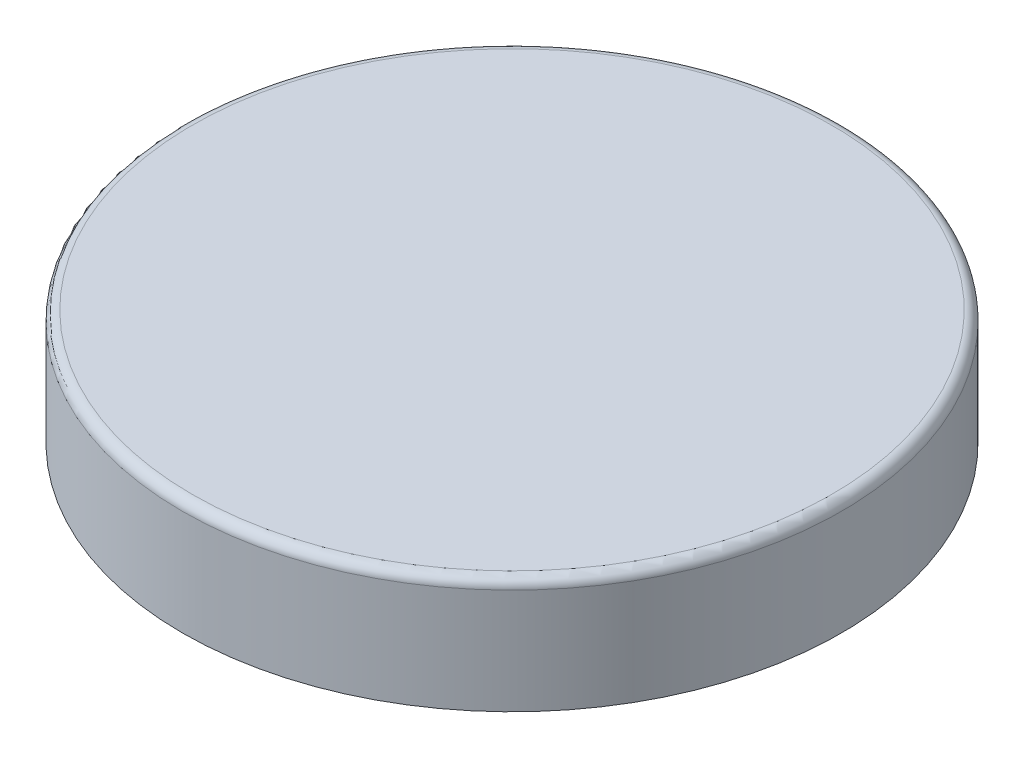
ISO-10303-21;
HEADER;
FILE_DESCRIPTION(('STEP AP214'),'2;1');
FILE_NAME('part.step','',(''),(''),'','','');
FILE_SCHEMA(('AUTOMOTIVE_DESIGN { 1 0 10303 214 1 1 1 1 }'));
ENDSEC;
DATA;
#1=APPLICATION_CONTEXT('core data for automotive mechanical design processes');
#2=APPLICATION_PROTOCOL_DEFINITION('international standard','automotive_design',2000,#1);
#3=PRODUCT_CONTEXT('',#1,'mechanical');
#4=PRODUCT('Part','Part','',(#3));
#5=PRODUCT_RELATED_PRODUCT_CATEGORY('part','',(#4));
#6=PRODUCT_DEFINITION_FORMATION('','',#4);
#7=PRODUCT_DEFINITION_CONTEXT('part definition',#1,'design');
#8=PRODUCT_DEFINITION('design','',#6,#7);
#9=PRODUCT_DEFINITION_SHAPE('','',#8);
#10=(LENGTH_UNIT() NAMED_UNIT(*) SI_UNIT(.MILLI.,.METRE.));
#11=(NAMED_UNIT(*) PLANE_ANGLE_UNIT() SI_UNIT($,.RADIAN.));
#12=(NAMED_UNIT(*) SI_UNIT($,.STERADIAN.) SOLID_ANGLE_UNIT());
#13=UNCERTAINTY_MEASURE_WITH_UNIT(LENGTH_MEASURE(1.E-05),#10,'distance_accuracy_value','');
#14=(GEOMETRIC_REPRESENTATION_CONTEXT(3) GLOBAL_UNCERTAINTY_ASSIGNED_CONTEXT((#13)) GLOBAL_UNIT_ASSIGNED_CONTEXT((#10,
#11,#12)) REPRESENTATION_CONTEXT('',''));
#15=CARTESIAN_POINT('',(0.,0.,0.));
#16=DIRECTION('',(0.,0.,1.));
#17=DIRECTION('',(1.,0.,0.));
#18=AXIS2_PLACEMENT_3D('',#15,#16,#17);
#19=CARTESIAN_POINT('',(0.,0.85,0.));
#20=DIRECTION('',(0.,-1.,0.));
#21=DIRECTION('',(0.,0.,-1.));
#22=AXIS2_PLACEMENT_3D('',#19,#20,#21);
#23=CYLINDRICAL_SURFACE('',#22,28.625);
#24=CARTESIAN_POINT('',(0.,0.,0.));
#25=DIRECTION('',(0.,1.,0.));
#26=DIRECTION('',(0.,0.,1.));
#27=AXIS2_PLACEMENT_3D('',#24,#25,#26);
#28=CIRCLE('',#27,28.625);
#29=CARTESIAN_POINT('',(0.,0.,28.625));
#30=VERTEX_POINT('',#29);
#31=EDGE_CURVE('E10',#30,#30,#28,.F.);
#32=ORIENTED_EDGE('',*,*,#31,.T.);
#33=EDGE_LOOP('',(#32));
#34=FACE_BOUND('',#33,.T.);
#35=CARTESIAN_POINT('',(0.,-9.15,0.));
#36=DIRECTION('',(0.,-1.,0.));
#37=DIRECTION('',(0.,0.,-1.));
#38=AXIS2_PLACEMENT_3D('',#35,#36,#37);
#39=CIRCLE('',#38,28.625);
#40=CARTESIAN_POINT('',(0.,-9.15,-28.625));
#41=VERTEX_POINT('',#40);
#42=EDGE_CURVE('E38',#41,#41,#39,.T.);
#43=ORIENTED_EDGE('',*,*,#42,.F.);
#44=EDGE_LOOP('',(#43));
#45=FACE_BOUND('',#44,.T.);
#46=ADVANCED_FACE('F28',(#34,#45),#23,.T.);
#47=CARTESIAN_POINT('',(0.,0.85,0.));
#48=DIRECTION('',(0.,1.,0.));
#49=DIRECTION('',(0.,0.,1.));
#50=AXIS2_PLACEMENT_3D('',#47,#48,#49);
#51=PLANE('',#50);
#52=CARTESIAN_POINT('',(0.,0.85,0.));
#53=DIRECTION('',(0.,1.,0.));
#54=DIRECTION('',(0.,0.,1.));
#55=AXIS2_PLACEMENT_3D('',#52,#53,#54);
#56=CIRCLE('',#55,27.775);
#57=CARTESIAN_POINT('',(0.,0.85,27.775));
#58=VERTEX_POINT('',#57);
#59=EDGE_CURVE('E34',#58,#58,#56,.T.);
#60=ORIENTED_EDGE('',*,*,#59,.T.);
#61=EDGE_LOOP('',(#60));
#62=FACE_BOUND('',#61,.T.);
#63=ADVANCED_FACE('F64',(#62),#51,.T.);
#64=CARTESIAN_POINT('',(0.,-9.15,0.));
#65=DIRECTION('',(0.,-1.,0.));
#66=DIRECTION('',(0.,0.,-1.));
#67=AXIS2_PLACEMENT_3D('',#64,#65,#66);
#68=PLANE('',#67);
#69=ORIENTED_EDGE('',*,*,#42,.T.);
#70=EDGE_LOOP('',(#69));
#71=FACE_BOUND('',#70,.T.);
#72=CARTESIAN_POINT('',(0.,-9.15,0.));
#73=DIRECTION('',(0.,-1.,0.));
#74=DIRECTION('',(0.,0.,-1.));
#75=AXIS2_PLACEMENT_3D('',#72,#73,#74);
#76=CIRCLE('',#75,27.775);
#77=CARTESIAN_POINT('',(0.,-9.15,-27.775));
#78=VERTEX_POINT('',#77);
#79=EDGE_CURVE('E42',#78,#78,#76,.T.);
#80=ORIENTED_EDGE('',*,*,#79,.F.);
#81=EDGE_LOOP('',(#80));
#82=FACE_BOUND('',#81,.T.);
#83=ADVANCED_FACE('F55',(#71,#82),#68,.T.);
#84=CARTESIAN_POINT('',(0.,-9.15,0.));
#85=DIRECTION('',(0.,1.,0.));
#86=DIRECTION('',(0.,0.,1.));
#87=AXIS2_PLACEMENT_3D('',#84,#85,#86);
#88=CYLINDRICAL_SURFACE('',#87,27.775);
#89=ORIENTED_EDGE('',*,*,#79,.T.);
#90=EDGE_LOOP('',(#89));
#91=FACE_BOUND('',#90,.T.);
#92=CARTESIAN_POINT('',(0.,0.,0.));
#93=DIRECTION('',(0.,-1.,0.));
#94=DIRECTION('',(0.,0.,-1.));
#95=AXIS2_PLACEMENT_3D('',#92,#93,#94);
#96=CIRCLE('',#95,27.775);
#97=CARTESIAN_POINT('',(0.,0.,-27.775));
#98=VERTEX_POINT('',#97);
#99=EDGE_CURVE('E47',#98,#98,#96,.T.);
#100=ORIENTED_EDGE('',*,*,#99,.F.);
#101=EDGE_LOOP('',(#100));
#102=FACE_BOUND('',#101,.T.);
#103=ADVANCED_FACE('F53',(#91,#102),#88,.F.);
#104=CARTESIAN_POINT('',(0.,0.,0.));
#105=DIRECTION('',(0.,1.,0.));
#106=DIRECTION('',(0.,0.,1.));
#107=AXIS2_PLACEMENT_3D('',#104,#105,#106);
#108=PLANE('',#107);
#109=ORIENTED_EDGE('',*,*,#99,.T.);
#110=EDGE_LOOP('',(#109));
#111=FACE_BOUND('',#110,.T.);
#112=ADVANCED_FACE('F51',(#111),#108,.F.);
#113=CARTESIAN_POINT('',(0.,0.,0.));
#114=DIRECTION('',(0.,1.,0.));
#115=DIRECTION('',(0.,0.,1.));
#116=AXIS2_PLACEMENT_3D('',#113,#114,#115);
#117=TOROIDAL_SURFACE('',#116,27.775,0.85);
#118=ORIENTED_EDGE('',*,*,#31,.F.);
#119=EDGE_LOOP('',(#118));
#120=FACE_BOUND('',#119,.T.);
#121=ORIENTED_EDGE('',*,*,#59,.F.);
#122=EDGE_LOOP('',(#121));
#123=FACE_BOUND('',#122,.T.);
#124=ADVANCED_FACE('F62',(#120,#123),#117,.T.);
#125=CLOSED_SHELL('',(#46,#63,#83,#103,#112,#124));
#126=MANIFOLD_SOLID_BREP('B2',#125);
#127=ADVANCED_BREP_SHAPE_REPRESENTATION('',(#18,#126),#14);
#128=SHAPE_DEFINITION_REPRESENTATION(#9,#127);
ENDSEC;
END-ISO-10303-21;
